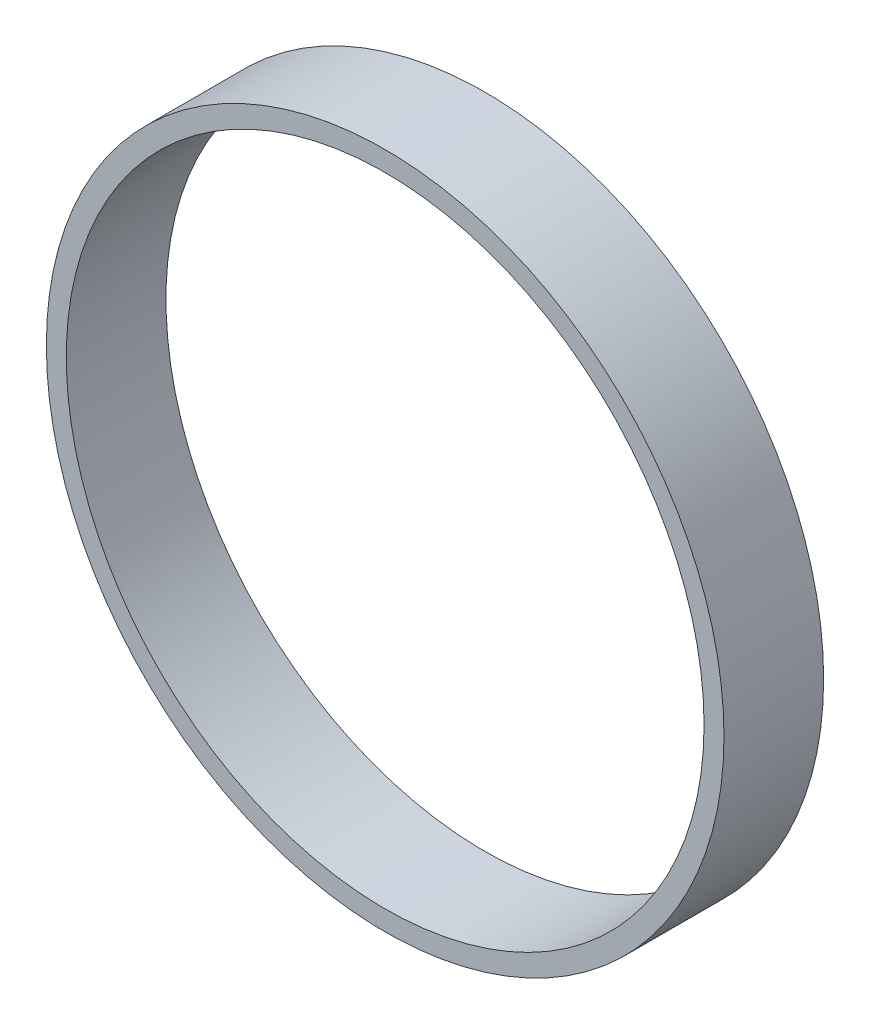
ISO-10303-21;
HEADER;
FILE_DESCRIPTION(('STEP AP214'),'2;1');
FILE_NAME('part.step','',(''),(''),'','','');
FILE_SCHEMA(('AUTOMOTIVE_DESIGN { 1 0 10303 214 1 1 1 1 }'));
ENDSEC;
DATA;
#1=APPLICATION_CONTEXT('core data for automotive mechanical design processes');
#2=APPLICATION_PROTOCOL_DEFINITION('international standard','automotive_design',2000,#1);
#3=PRODUCT_CONTEXT('',#1,'mechanical');
#4=PRODUCT('Part','Part','',(#3));
#5=PRODUCT_RELATED_PRODUCT_CATEGORY('part','',(#4));
#6=PRODUCT_DEFINITION_FORMATION('','',#4);
#7=PRODUCT_DEFINITION_CONTEXT('part definition',#1,'design');
#8=PRODUCT_DEFINITION('design','',#6,#7);
#9=PRODUCT_DEFINITION_SHAPE('','',#8);
#10=(LENGTH_UNIT() NAMED_UNIT(*) SI_UNIT(.MILLI.,.METRE.));
#11=(NAMED_UNIT(*) PLANE_ANGLE_UNIT() SI_UNIT($,.RADIAN.));
#12=(NAMED_UNIT(*) SI_UNIT($,.STERADIAN.) SOLID_ANGLE_UNIT());
#13=UNCERTAINTY_MEASURE_WITH_UNIT(LENGTH_MEASURE(1.E-05),#10,'distance_accuracy_value','');
#14=(GEOMETRIC_REPRESENTATION_CONTEXT(3) GLOBAL_UNCERTAINTY_ASSIGNED_CONTEXT((#13)) GLOBAL_UNIT_ASSIGNED_CONTEXT((#10,
#11,#12)) REPRESENTATION_CONTEXT('',''));
#15=CARTESIAN_POINT('',(0.,0.,0.));
#16=DIRECTION('',(0.,0.,1.));
#17=DIRECTION('',(1.,0.,0.));
#18=AXIS2_PLACEMENT_3D('',#15,#16,#17);
#19=CARTESIAN_POINT('',(0.,0.,10.));
#20=DIRECTION('',(0.,0.,1.));
#21=DIRECTION('',(1.,0.,0.));
#22=AXIS2_PLACEMENT_3D('',#19,#20,#21);
#23=PLANE('',#22);
#24=CARTESIAN_POINT('',(0.,0.,10.));
#25=DIRECTION('',(0.,0.,1.));
#26=DIRECTION('',(1.,0.,0.));
#27=AXIS2_PLACEMENT_3D('',#24,#25,#26);
#28=CIRCLE('',#27,34.);
#29=CARTESIAN_POINT('',(34.,0.,10.));
#30=VERTEX_POINT('',#29);
#31=EDGE_CURVE('E10',#30,#30,#28,.T.);
#32=ORIENTED_EDGE('',*,*,#31,.T.);
#33=EDGE_LOOP('',(#32));
#34=FACE_BOUND('',#33,.T.);
#35=CARTESIAN_POINT('',(0.,0.,10.));
#36=DIRECTION('',(0.,0.,1.));
#37=DIRECTION('',(1.,0.,0.));
#38=AXIS2_PLACEMENT_3D('',#35,#36,#37);
#39=CIRCLE('',#38,32.);
#40=CARTESIAN_POINT('',(32.,0.,10.));
#41=VERTEX_POINT('',#40);
#42=EDGE_CURVE('E46',#41,#41,#39,.T.);
#43=ORIENTED_EDGE('',*,*,#42,.F.);
#44=EDGE_LOOP('',(#43));
#45=FACE_BOUND('',#44,.T.);
#46=ADVANCED_FACE('F35',(#34,#45),#23,.T.);
#47=CARTESIAN_POINT('',(0.,0.,0.));
#48=DIRECTION('',(0.,0.,1.));
#49=DIRECTION('',(1.,0.,0.));
#50=AXIS2_PLACEMENT_3D('',#47,#48,#49);
#51=PLANE('',#50);
#52=CARTESIAN_POINT('',(0.,0.,0.));
#53=DIRECTION('',(0.,0.,1.));
#54=DIRECTION('',(1.,0.,0.));
#55=AXIS2_PLACEMENT_3D('',#52,#53,#54);
#56=CIRCLE('',#55,34.);
#57=CARTESIAN_POINT('',(34.,0.,0.));
#58=VERTEX_POINT('',#57);
#59=EDGE_CURVE('E39',#58,#58,#56,.T.);
#60=ORIENTED_EDGE('',*,*,#59,.F.);
#61=EDGE_LOOP('',(#60));
#62=FACE_BOUND('',#61,.T.);
#63=CARTESIAN_POINT('',(0.,0.,0.));
#64=DIRECTION('',(0.,0.,1.));
#65=DIRECTION('',(1.,0.,0.));
#66=AXIS2_PLACEMENT_3D('',#63,#64,#65);
#67=CIRCLE('',#66,32.);
#68=CARTESIAN_POINT('',(32.,0.,0.));
#69=VERTEX_POINT('',#68);
#70=EDGE_CURVE('E48',#69,#69,#67,.T.);
#71=ORIENTED_EDGE('',*,*,#70,.T.);
#72=EDGE_LOOP('',(#71));
#73=FACE_BOUND('',#72,.T.);
#74=ADVANCED_FACE('F58',(#62,#73),#51,.F.);
#75=CARTESIAN_POINT('',(0.,0.,10.));
#76=DIRECTION('',(0.,0.,-1.));
#77=DIRECTION('',(-1.,0.,0.));
#78=AXIS2_PLACEMENT_3D('',#75,#76,#77);
#79=CYLINDRICAL_SURFACE('',#78,34.);
#80=ORIENTED_EDGE('',*,*,#31,.F.);
#81=EDGE_LOOP('',(#80));
#82=FACE_BOUND('',#81,.T.);
#83=ORIENTED_EDGE('',*,*,#59,.T.);
#84=EDGE_LOOP('',(#83));
#85=FACE_BOUND('',#84,.T.);
#86=ADVANCED_FACE('F37',(#82,#85),#79,.T.);
#87=CARTESIAN_POINT('',(0.,0.,10.));
#88=DIRECTION('',(0.,0.,-1.));
#89=DIRECTION('',(-1.,0.,0.));
#90=AXIS2_PLACEMENT_3D('',#87,#88,#89);
#91=CYLINDRICAL_SURFACE('',#90,32.);
#92=ORIENTED_EDGE('',*,*,#42,.T.);
#93=EDGE_LOOP('',(#92));
#94=FACE_BOUND('',#93,.T.);
#95=ORIENTED_EDGE('',*,*,#70,.F.);
#96=EDGE_LOOP('',(#95));
#97=FACE_BOUND('',#96,.T.);
#98=ADVANCED_FACE('F54',(#94,#97),#91,.F.);
#99=CLOSED_SHELL('',(#46,#74,#86,#98));
#100=MANIFOLD_SOLID_BREP('B2',#99);
#101=ADVANCED_BREP_SHAPE_REPRESENTATION('',(#18,#100),#14);
#102=SHAPE_DEFINITION_REPRESENTATION(#9,#101);
ENDSEC;
END-ISO-10303-21;
